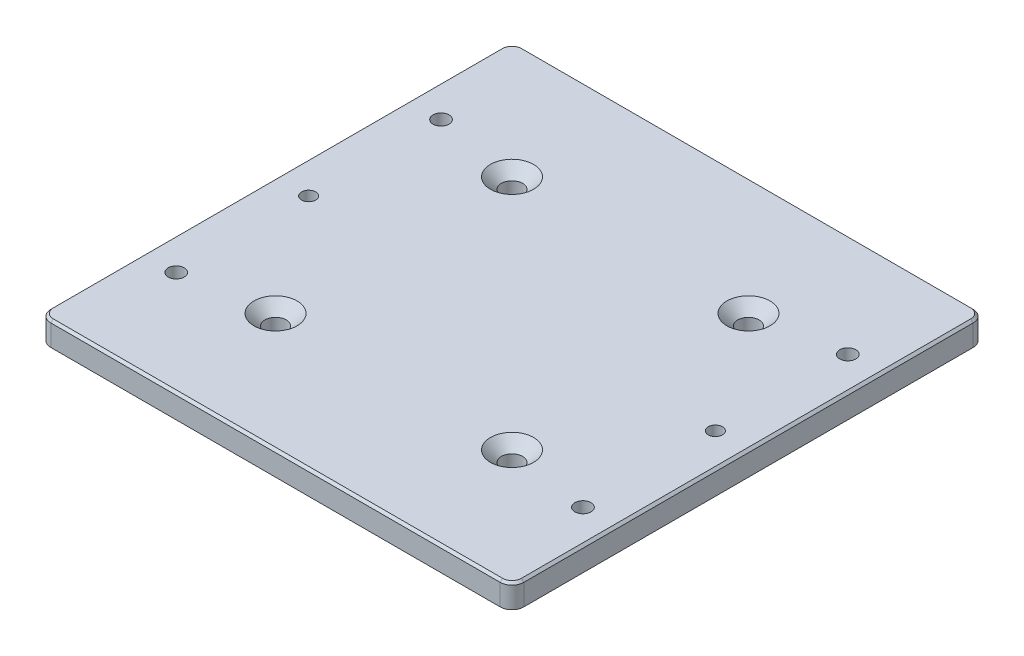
ISO-10303-21;
HEADER;
FILE_DESCRIPTION(('STEP AP214'),'2;1');
FILE_NAME('part.step','',(''),(''),'','','');
FILE_SCHEMA(('AUTOMOTIVE_DESIGN { 1 0 10303 214 1 1 1 1 }'));
ENDSEC;
DATA;
#1=APPLICATION_CONTEXT('core data for automotive mechanical design processes');
#2=APPLICATION_PROTOCOL_DEFINITION('international standard','automotive_design',2000,#1);
#3=PRODUCT_CONTEXT('',#1,'mechanical');
#4=PRODUCT('Part','Part','',(#3));
#5=PRODUCT_RELATED_PRODUCT_CATEGORY('part','',(#4));
#6=PRODUCT_DEFINITION_FORMATION('','',#4);
#7=PRODUCT_DEFINITION_CONTEXT('part definition',#1,'design');
#8=PRODUCT_DEFINITION('design','',#6,#7);
#9=PRODUCT_DEFINITION_SHAPE('','',#8);
#10=(LENGTH_UNIT() NAMED_UNIT(*) SI_UNIT(.MILLI.,.METRE.));
#11=(NAMED_UNIT(*) PLANE_ANGLE_UNIT() SI_UNIT($,.RADIAN.));
#12=(NAMED_UNIT(*) SI_UNIT($,.STERADIAN.) SOLID_ANGLE_UNIT());
#13=UNCERTAINTY_MEASURE_WITH_UNIT(LENGTH_MEASURE(1.E-05),#10,'distance_accuracy_value','');
#14=(GEOMETRIC_REPRESENTATION_CONTEXT(3) GLOBAL_UNCERTAINTY_ASSIGNED_CONTEXT((#13)) GLOBAL_UNIT_ASSIGNED_CONTEXT((#10,
#11,#12)) REPRESENTATION_CONTEXT('',''));
#15=CARTESIAN_POINT('',(0.,0.,0.));
#16=DIRECTION('',(0.,0.,1.));
#17=DIRECTION('',(1.,0.,0.));
#18=AXIS2_PLACEMENT_3D('',#15,#16,#17);
#19=CARTESIAN_POINT('',(100.,-10.,100.));
#20=DIRECTION('',(1.,0.,0.));
#21=DIRECTION('',(0.,0.,-1.));
#22=AXIS2_PLACEMENT_3D('',#19,#20,#21);
#23=PLANE('',#22);
#24=DIRECTION('',(0.,1.,0.));
#25=VECTOR('',#24,1.);
#26=CARTESIAN_POINT('',(100.,-10.,-95.));
#27=LINE('',#26,#25);
#28=CARTESIAN_POINT('',(100.,-10.,-95.));
#29=VERTEX_POINT('',#28);
#30=CARTESIAN_POINT('',(100.,-1.,-95.));
#31=VERTEX_POINT('',#30);
#32=EDGE_CURVE('E137',#29,#31,#27,.T.);
#33=ORIENTED_EDGE('',*,*,#32,.T.);
#34=DIRECTION('',(0.,0.,1.));
#35=VECTOR('',#34,1.);
#36=CARTESIAN_POINT('',(100.,-1.,95.));
#37=LINE('',#36,#35);
#38=CARTESIAN_POINT('',(100.,-1.,95.));
#39=VERTEX_POINT('',#38);
#40=EDGE_CURVE('E133',#31,#39,#37,.T.);
#41=ORIENTED_EDGE('',*,*,#40,.T.);
#42=DIRECTION('',(0.,1.,0.));
#43=VECTOR('',#42,1.);
#44=CARTESIAN_POINT('',(100.,-10.,95.));
#45=LINE('',#44,#43);
#46=CARTESIAN_POINT('',(100.,-10.,95.));
#47=VERTEX_POINT('',#46);
#48=EDGE_CURVE('E127',#39,#47,#45,.F.);
#49=ORIENTED_EDGE('',*,*,#48,.T.);
#50=DIRECTION('',(0.,0.,-1.));
#51=VECTOR('',#50,1.);
#52=CARTESIAN_POINT('',(100.,-10.,100.));
#53=LINE('',#52,#51);
#54=EDGE_CURVE('E130',#47,#29,#53,.T.);
#55=ORIENTED_EDGE('',*,*,#54,.T.);
#56=EDGE_LOOP('',(#33,#41,#49,#55));
#57=FACE_BOUND('',#56,.T.);
#58=ADVANCED_FACE('F37',(#57),#23,.T.);
#59=CARTESIAN_POINT('',(-100.,-10.,100.));
#60=DIRECTION('',(0.,0.,1.));
#61=DIRECTION('',(1.,0.,0.));
#62=AXIS2_PLACEMENT_3D('',#59,#60,#61);
#63=PLANE('',#62);
#64=DIRECTION('',(0.,1.,0.));
#65=VECTOR('',#64,1.);
#66=CARTESIAN_POINT('',(95.,-10.,100.));
#67=LINE('',#66,#65);
#68=CARTESIAN_POINT('',(95.,-10.,100.));
#69=VERTEX_POINT('',#68);
#70=CARTESIAN_POINT('',(95.,-1.,100.));
#71=VERTEX_POINT('',#70);
#72=EDGE_CURVE('E154',#69,#71,#67,.T.);
#73=ORIENTED_EDGE('',*,*,#72,.T.);
#74=DIRECTION('',(-1.,0.,0.));
#75=VECTOR('',#74,1.);
#76=CARTESIAN_POINT('',(-95.,-1.,100.));
#77=LINE('',#76,#75);
#78=CARTESIAN_POINT('',(-95.,-1.,100.));
#79=VERTEX_POINT('',#78);
#80=EDGE_CURVE('E191',#71,#79,#77,.T.);
#81=ORIENTED_EDGE('',*,*,#80,.T.);
#82=DIRECTION('',(0.,1.,0.));
#83=VECTOR('',#82,1.);
#84=CARTESIAN_POINT('',(-95.,-10.,100.));
#85=LINE('',#84,#83);
#86=CARTESIAN_POINT('',(-95.,-10.,100.));
#87=VERTEX_POINT('',#86);
#88=EDGE_CURVE('E172',#79,#87,#85,.F.);
#89=ORIENTED_EDGE('',*,*,#88,.T.);
#90=DIRECTION('',(1.,0.,0.));
#91=VECTOR('',#90,1.);
#92=CARTESIAN_POINT('',(-100.,-10.,100.));
#93=LINE('',#92,#91);
#94=EDGE_CURVE('E138',#87,#69,#93,.T.);
#95=ORIENTED_EDGE('',*,*,#94,.T.);
#96=EDGE_LOOP('',(#73,#81,#89,#95));
#97=FACE_BOUND('',#96,.T.);
#98=ADVANCED_FACE('F342',(#97),#63,.T.);
#99=CARTESIAN_POINT('',(-100.,-10.,100.));
#100=DIRECTION('',(-1.,0.,0.));
#101=DIRECTION('',(0.,0.,1.));
#102=AXIS2_PLACEMENT_3D('',#99,#100,#101);
#103=PLANE('',#102);
#104=DIRECTION('',(0.,1.,0.));
#105=VECTOR('',#104,1.);
#106=CARTESIAN_POINT('',(-100.,-10.,95.));
#107=LINE('',#106,#105);
#108=CARTESIAN_POINT('',(-100.,-10.,95.));
#109=VERTEX_POINT('',#108);
#110=CARTESIAN_POINT('',(-100.,-1.,95.));
#111=VERTEX_POINT('',#110);
#112=EDGE_CURVE('E166',#109,#111,#107,.T.);
#113=ORIENTED_EDGE('',*,*,#112,.T.);
#114=DIRECTION('',(0.,0.,-1.));
#115=VECTOR('',#114,1.);
#116=CARTESIAN_POINT('',(-100.,-1.,-95.));
#117=LINE('',#116,#115);
#118=CARTESIAN_POINT('',(-100.,-1.,-95.));
#119=VERTEX_POINT('',#118);
#120=EDGE_CURVE('E199',#111,#119,#117,.T.);
#121=ORIENTED_EDGE('',*,*,#120,.T.);
#122=DIRECTION('',(0.,1.,0.));
#123=VECTOR('',#122,1.);
#124=CARTESIAN_POINT('',(-100.,-10.,-95.));
#125=LINE('',#124,#123);
#126=CARTESIAN_POINT('',(-100.,-10.,-95.));
#127=VERTEX_POINT('',#126);
#128=EDGE_CURVE('E169',#119,#127,#125,.F.);
#129=ORIENTED_EDGE('',*,*,#128,.T.);
#130=DIRECTION('',(0.,0.,1.));
#131=VECTOR('',#130,1.);
#132=CARTESIAN_POINT('',(-100.,-10.,100.));
#133=LINE('',#132,#131);
#134=EDGE_CURVE('E305',#127,#109,#133,.T.);
#135=ORIENTED_EDGE('',*,*,#134,.T.);
#136=EDGE_LOOP('',(#113,#121,#129,#135));
#137=FACE_BOUND('',#136,.T.);
#138=ADVANCED_FACE('F354',(#137),#103,.T.);
#139=CARTESIAN_POINT('',(-100.,-10.,-100.));
#140=DIRECTION('',(0.,0.,-1.));
#141=DIRECTION('',(-1.,0.,0.));
#142=AXIS2_PLACEMENT_3D('',#139,#140,#141);
#143=PLANE('',#142);
#144=DIRECTION('',(0.,1.,0.));
#145=VECTOR('',#144,1.);
#146=CARTESIAN_POINT('',(-95.,-10.,-100.));
#147=LINE('',#146,#145);
#148=CARTESIAN_POINT('',(-95.,-10.,-100.));
#149=VERTEX_POINT('',#148);
#150=CARTESIAN_POINT('',(-95.,-1.,-100.));
#151=VERTEX_POINT('',#150);
#152=EDGE_CURVE('E160',#149,#151,#147,.T.);
#153=ORIENTED_EDGE('',*,*,#152,.T.);
#154=DIRECTION('',(1.,0.,0.));
#155=VECTOR('',#154,1.);
#156=CARTESIAN_POINT('',(95.,-1.,-100.));
#157=LINE('',#156,#155);
#158=CARTESIAN_POINT('',(95.,-1.,-100.));
#159=VERTEX_POINT('',#158);
#160=EDGE_CURVE('E11',#151,#159,#157,.T.);
#161=ORIENTED_EDGE('',*,*,#160,.T.);
#162=DIRECTION('',(0.,1.,0.));
#163=VECTOR('',#162,1.);
#164=CARTESIAN_POINT('',(95.,-10.,-100.));
#165=LINE('',#164,#163);
#166=CARTESIAN_POINT('',(95.,-10.,-100.));
#167=VERTEX_POINT('',#166);
#168=EDGE_CURVE('E156',#159,#167,#165,.F.);
#169=ORIENTED_EDGE('',*,*,#168,.T.);
#170=DIRECTION('',(-1.,0.,0.));
#171=VECTOR('',#170,1.);
#172=CARTESIAN_POINT('',(-100.,-10.,-100.));
#173=LINE('',#172,#171);
#174=EDGE_CURVE('E148',#167,#149,#173,.T.);
#175=ORIENTED_EDGE('',*,*,#174,.T.);
#176=EDGE_LOOP('',(#153,#161,#169,#175));
#177=FACE_BOUND('',#176,.T.);
#178=ADVANCED_FACE('F309',(#177),#143,.T.);
#179=CARTESIAN_POINT('',(0.,-10.,0.));
#180=DIRECTION('',(0.,-1.,0.));
#181=DIRECTION('',(0.,0.,-1.));
#182=AXIS2_PLACEMENT_3D('',#179,#180,#181);
#183=PLANE('',#182);
#184=CARTESIAN_POINT('',(86.,-10.,0.));
#185=DIRECTION('',(0.,1.,0.));
#186=DIRECTION('',(0.,0.,1.));
#187=AXIS2_PLACEMENT_3D('',#184,#185,#186);
#188=CIRCLE('',#187,3.);
#189=CARTESIAN_POINT('',(86.,-10.,3.00000000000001));
#190=VERTEX_POINT('',#189);
#191=EDGE_CURVE('E231',#190,#190,#188,.T.);
#192=ORIENTED_EDGE('',*,*,#191,.T.);
#193=EDGE_LOOP('',(#192));
#194=FACE_BOUND('',#193,.T.);
#195=CARTESIAN_POINT('',(-86.,-10.,0.));
#196=DIRECTION('',(0.,1.,0.));
#197=DIRECTION('',(0.,0.,1.));
#198=AXIS2_PLACEMENT_3D('',#195,#196,#197);
#199=CIRCLE('',#198,3.);
#200=CARTESIAN_POINT('',(-86.,-10.,3.00000000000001));
#201=VERTEX_POINT('',#200);
#202=EDGE_CURVE('E241',#201,#201,#199,.T.);
#203=ORIENTED_EDGE('',*,*,#202,.T.);
#204=EDGE_LOOP('',(#203));
#205=FACE_BOUND('',#204,.T.);
#206=CARTESIAN_POINT('',(-50.,-10.,50.));
#207=DIRECTION('',(0.,1.,0.));
#208=DIRECTION('',(0.,0.,1.));
#209=AXIS2_PLACEMENT_3D('',#206,#207,#208);
#210=CIRCLE('',#209,4.5);
#211=CARTESIAN_POINT('',(-50.,-10.,54.5));
#212=VERTEX_POINT('',#211);
#213=EDGE_CURVE('E250',#212,#212,#210,.T.);
#214=ORIENTED_EDGE('',*,*,#213,.T.);
#215=EDGE_LOOP('',(#214));
#216=FACE_BOUND('',#215,.T.);
#217=CARTESIAN_POINT('',(50.,-10.,-50.));
#218=DIRECTION('',(0.,1.,0.));
#219=DIRECTION('',(0.,0.,1.));
#220=AXIS2_PLACEMENT_3D('',#217,#218,#219);
#221=CIRCLE('',#220,4.5);
#222=CARTESIAN_POINT('',(50.,-10.,-45.5));
#223=VERTEX_POINT('',#222);
#224=EDGE_CURVE('E259',#223,#223,#221,.T.);
#225=ORIENTED_EDGE('',*,*,#224,.T.);
#226=EDGE_LOOP('',(#225));
#227=FACE_BOUND('',#226,.T.);
#228=CARTESIAN_POINT('',(-50.,-10.,-50.));
#229=DIRECTION('',(0.,1.,0.));
#230=DIRECTION('',(0.,0.,1.));
#231=AXIS2_PLACEMENT_3D('',#228,#229,#230);
#232=CIRCLE('',#231,4.5);
#233=CARTESIAN_POINT('',(-50.,-10.,-45.5));
#234=VERTEX_POINT('',#233);
#235=EDGE_CURVE('E268',#234,#234,#232,.T.);
#236=ORIENTED_EDGE('',*,*,#235,.T.);
#237=EDGE_LOOP('',(#236));
#238=FACE_BOUND('',#237,.T.);
#239=CARTESIAN_POINT('',(50.,-10.,50.));
#240=DIRECTION('',(0.,1.,0.));
#241=DIRECTION('',(0.,0.,1.));
#242=AXIS2_PLACEMENT_3D('',#239,#240,#241);
#243=CIRCLE('',#242,4.5);
#244=CARTESIAN_POINT('',(50.,-10.,54.5));
#245=VERTEX_POINT('',#244);
#246=EDGE_CURVE('E277',#245,#245,#243,.T.);
#247=ORIENTED_EDGE('',*,*,#246,.T.);
#248=EDGE_LOOP('',(#247));
#249=FACE_BOUND('',#248,.T.);
#250=CARTESIAN_POINT('',(-86.,-10.,56.));
#251=DIRECTION('',(0.,1.,0.));
#252=DIRECTION('',(0.,0.,1.));
#253=AXIS2_PLACEMENT_3D('',#250,#251,#252);
#254=CIRCLE('',#253,3.4);
#255=CARTESIAN_POINT('',(-86.,-10.,59.4));
#256=VERTEX_POINT('',#255);
#257=EDGE_CURVE('E283',#256,#256,#254,.T.);
#258=ORIENTED_EDGE('',*,*,#257,.T.);
#259=EDGE_LOOP('',(#258));
#260=FACE_BOUND('',#259,.T.);
#261=CARTESIAN_POINT('',(86.,-10.,-56.));
#262=DIRECTION('',(0.,1.,0.));
#263=DIRECTION('',(0.,0.,1.));
#264=AXIS2_PLACEMENT_3D('',#261,#262,#263);
#265=CIRCLE('',#264,3.4);
#266=CARTESIAN_POINT('',(86.,-10.,-52.6));
#267=VERTEX_POINT('',#266);
#268=EDGE_CURVE('E289',#267,#267,#265,.T.);
#269=ORIENTED_EDGE('',*,*,#268,.T.);
#270=EDGE_LOOP('',(#269));
#271=FACE_BOUND('',#270,.T.);
#272=CARTESIAN_POINT('',(-86.,-10.,-56.));
#273=DIRECTION('',(0.,1.,0.));
#274=DIRECTION('',(0.,0.,1.));
#275=AXIS2_PLACEMENT_3D('',#272,#273,#274);
#276=CIRCLE('',#275,3.4);
#277=CARTESIAN_POINT('',(-86.,-10.,-52.6));
#278=VERTEX_POINT('',#277);
#279=EDGE_CURVE('E295',#278,#278,#276,.T.);
#280=ORIENTED_EDGE('',*,*,#279,.T.);
#281=EDGE_LOOP('',(#280));
#282=FACE_BOUND('',#281,.T.);
#283=CARTESIAN_POINT('',(86.,-10.,56.));
#284=DIRECTION('',(0.,1.,0.));
#285=DIRECTION('',(0.,0.,1.));
#286=AXIS2_PLACEMENT_3D('',#283,#284,#285);
#287=CIRCLE('',#286,3.4);
#288=CARTESIAN_POINT('',(86.,-10.,59.4));
#289=VERTEX_POINT('',#288);
#290=EDGE_CURVE('E149',#289,#289,#287,.T.);
#291=ORIENTED_EDGE('',*,*,#290,.T.);
#292=EDGE_LOOP('',(#291));
#293=FACE_BOUND('',#292,.T.);
#294=ORIENTED_EDGE('',*,*,#174,.F.);
#295=CARTESIAN_POINT('',(95.,-10.,-95.));
#296=DIRECTION('',(0.,-1.,0.));
#297=DIRECTION('',(0.,0.,-1.));
#298=AXIS2_PLACEMENT_3D('',#295,#296,#297);
#299=CIRCLE('',#298,5.);
#300=EDGE_CURVE('E147',#167,#29,#299,.T.);
#301=ORIENTED_EDGE('',*,*,#300,.T.);
#302=ORIENTED_EDGE('',*,*,#54,.F.);
#303=CARTESIAN_POINT('',(95.,-10.,95.));
#304=DIRECTION('',(0.,-1.,0.));
#305=DIRECTION('',(0.,0.,-1.));
#306=AXIS2_PLACEMENT_3D('',#303,#304,#305);
#307=CIRCLE('',#306,5.);
#308=EDGE_CURVE('E144',#47,#69,#307,.T.);
#309=ORIENTED_EDGE('',*,*,#308,.T.);
#310=ORIENTED_EDGE('',*,*,#94,.F.);
#311=CARTESIAN_POINT('',(-95.,-10.,95.));
#312=DIRECTION('',(0.,-1.,0.));
#313=DIRECTION('',(0.,0.,-1.));
#314=AXIS2_PLACEMENT_3D('',#311,#312,#313);
#315=CIRCLE('',#314,5.);
#316=EDGE_CURVE('E155',#87,#109,#315,.T.);
#317=ORIENTED_EDGE('',*,*,#316,.T.);
#318=ORIENTED_EDGE('',*,*,#134,.F.);
#319=CARTESIAN_POINT('',(-95.,-10.,-95.));
#320=DIRECTION('',(0.,-1.,0.));
#321=DIRECTION('',(0.,0.,-1.));
#322=AXIS2_PLACEMENT_3D('',#319,#320,#321);
#323=CIRCLE('',#322,5.);
#324=EDGE_CURVE('E158',#127,#149,#323,.T.);
#325=ORIENTED_EDGE('',*,*,#324,.T.);
#326=EDGE_LOOP('',(#294,#301,#302,#309,#310,#317,#318,#325));
#327=FACE_BOUND('',#326,.T.);
#328=ADVANCED_FACE('F142',(#194,#205,#216,#227,#238,#249,#260,#271,#282,#293,#327),#183,.T.);
#329=CARTESIAN_POINT('',(0.,0.,0.));
#330=DIRECTION('',(0.,-1.,0.));
#331=DIRECTION('',(0.,0.,-1.));
#332=AXIS2_PLACEMENT_3D('',#329,#330,#331);
#333=PLANE('',#332);
#334=CARTESIAN_POINT('',(-95.,0.,95.));
#335=DIRECTION('',(0.,-1.,0.));
#336=DIRECTION('',(0.,0.,-1.));
#337=AXIS2_PLACEMENT_3D('',#334,#335,#336);
#338=CIRCLE('',#337,4.);
#339=CARTESIAN_POINT('',(-99.,0.,95.));
#340=VERTEX_POINT('',#339);
#341=CARTESIAN_POINT('',(-95.,0.,99.));
#342=VERTEX_POINT('',#341);
#343=EDGE_CURVE('E184',#340,#342,#338,.F.);
#344=ORIENTED_EDGE('',*,*,#343,.T.);
#345=DIRECTION('',(1.,0.,0.));
#346=VECTOR('',#345,1.);
#347=CARTESIAN_POINT('',(95.,0.,99.));
#348=LINE('',#347,#346);
#349=CARTESIAN_POINT('',(95.,0.,99.));
#350=VERTEX_POINT('',#349);
#351=EDGE_CURVE('E188',#342,#350,#348,.T.);
#352=ORIENTED_EDGE('',*,*,#351,.T.);
#353=CARTESIAN_POINT('',(95.,0.,95.));
#354=DIRECTION('',(0.,-1.,0.));
#355=DIRECTION('',(0.,0.,-1.));
#356=AXIS2_PLACEMENT_3D('',#353,#354,#355);
#357=CIRCLE('',#356,4.);
#358=CARTESIAN_POINT('',(99.,0.,95.));
#359=VERTEX_POINT('',#358);
#360=EDGE_CURVE('E186',#350,#359,#357,.F.);
#361=ORIENTED_EDGE('',*,*,#360,.T.);
#362=DIRECTION('',(0.,0.,-1.));
#363=VECTOR('',#362,1.);
#364=CARTESIAN_POINT('',(99.,0.,-95.));
#365=LINE('',#364,#363);
#366=CARTESIAN_POINT('',(99.,0.,-95.));
#367=VERTEX_POINT('',#366);
#368=EDGE_CURVE('E182',#359,#367,#365,.T.);
#369=ORIENTED_EDGE('',*,*,#368,.T.);
#370=CARTESIAN_POINT('',(95.,0.,-95.));
#371=DIRECTION('',(0.,-1.,0.));
#372=DIRECTION('',(0.,0.,-1.));
#373=AXIS2_PLACEMENT_3D('',#370,#371,#372);
#374=CIRCLE('',#373,4.);
#375=CARTESIAN_POINT('',(95.,0.,-99.));
#376=VERTEX_POINT('',#375);
#377=EDGE_CURVE('E178',#367,#376,#374,.F.);
#378=ORIENTED_EDGE('',*,*,#377,.T.);
#379=DIRECTION('',(-1.,0.,0.));
#380=VECTOR('',#379,1.);
#381=CARTESIAN_POINT('',(-95.,0.,-99.));
#382=LINE('',#381,#380);
#383=CARTESIAN_POINT('',(-95.,0.,-99.));
#384=VERTEX_POINT('',#383);
#385=EDGE_CURVE('E174',#376,#384,#382,.T.);
#386=ORIENTED_EDGE('',*,*,#385,.T.);
#387=CARTESIAN_POINT('',(-95.,0.,-95.));
#388=DIRECTION('',(0.,-1.,0.));
#389=DIRECTION('',(0.,0.,-1.));
#390=AXIS2_PLACEMENT_3D('',#387,#388,#389);
#391=CIRCLE('',#390,4.);
#392=CARTESIAN_POINT('',(-99.,0.,-95.));
#393=VERTEX_POINT('',#392);
#394=EDGE_CURVE('E176',#384,#393,#391,.F.);
#395=ORIENTED_EDGE('',*,*,#394,.T.);
#396=DIRECTION('',(0.,0.,1.));
#397=VECTOR('',#396,1.);
#398=CARTESIAN_POINT('',(-99.,0.,95.));
#399=LINE('',#398,#397);
#400=EDGE_CURVE('E180',#393,#340,#399,.T.);
#401=ORIENTED_EDGE('',*,*,#400,.T.);
#402=EDGE_LOOP('',(#344,#352,#361,#369,#378,#386,#395,#401));
#403=FACE_BOUND('',#402,.T.);
#404=CARTESIAN_POINT('',(86.,0.,0.));
#405=DIRECTION('',(0.,1.,0.));
#406=DIRECTION('',(0.,0.,1.));
#407=AXIS2_PLACEMENT_3D('',#404,#405,#406);
#408=CIRCLE('',#407,3.);
#409=CARTESIAN_POINT('',(86.,0.,3.00000000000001));
#410=VERTEX_POINT('',#409);
#411=EDGE_CURVE('E226',#410,#410,#408,.T.);
#412=ORIENTED_EDGE('',*,*,#411,.F.);
#413=EDGE_LOOP('',(#412));
#414=FACE_BOUND('',#413,.T.);
#415=CARTESIAN_POINT('',(-86.,0.,0.));
#416=DIRECTION('',(0.,1.,0.));
#417=DIRECTION('',(0.,0.,1.));
#418=AXIS2_PLACEMENT_3D('',#415,#416,#417);
#419=CIRCLE('',#418,3.);
#420=CARTESIAN_POINT('',(-86.,0.,3.00000000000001));
#421=VERTEX_POINT('',#420);
#422=EDGE_CURVE('E236',#421,#421,#419,.T.);
#423=ORIENTED_EDGE('',*,*,#422,.F.);
#424=EDGE_LOOP('',(#423));
#425=FACE_BOUND('',#424,.T.);
#426=CARTESIAN_POINT('',(-50.,0.,50.));
#427=DIRECTION('',(0.,1.,0.));
#428=DIRECTION('',(0.,0.,1.));
#429=AXIS2_PLACEMENT_3D('',#426,#427,#428);
#430=CIRCLE('',#429,9.125);
#431=CARTESIAN_POINT('',(-50.,0.,59.125));
#432=VERTEX_POINT('',#431);
#433=EDGE_CURVE('E244',#432,#432,#430,.T.);
#434=ORIENTED_EDGE('',*,*,#433,.F.);
#435=EDGE_LOOP('',(#434));
#436=FACE_BOUND('',#435,.T.);
#437=CARTESIAN_POINT('',(50.,0.,-50.));
#438=DIRECTION('',(0.,1.,0.));
#439=DIRECTION('',(0.,0.,1.));
#440=AXIS2_PLACEMENT_3D('',#437,#438,#439);
#441=CIRCLE('',#440,9.125);
#442=CARTESIAN_POINT('',(50.,0.,-40.875));
#443=VERTEX_POINT('',#442);
#444=EDGE_CURVE('E253',#443,#443,#441,.T.);
#445=ORIENTED_EDGE('',*,*,#444,.F.);
#446=EDGE_LOOP('',(#445));
#447=FACE_BOUND('',#446,.T.);
#448=CARTESIAN_POINT('',(-50.,0.,-50.));
#449=DIRECTION('',(0.,1.,0.));
#450=DIRECTION('',(0.,0.,1.));
#451=AXIS2_PLACEMENT_3D('',#448,#449,#450);
#452=CIRCLE('',#451,9.125);
#453=CARTESIAN_POINT('',(-50.,0.,-40.875));
#454=VERTEX_POINT('',#453);
#455=EDGE_CURVE('E262',#454,#454,#452,.T.);
#456=ORIENTED_EDGE('',*,*,#455,.F.);
#457=EDGE_LOOP('',(#456));
#458=FACE_BOUND('',#457,.T.);
#459=CARTESIAN_POINT('',(50.,0.,50.));
#460=DIRECTION('',(0.,1.,0.));
#461=DIRECTION('',(0.,0.,1.));
#462=AXIS2_PLACEMENT_3D('',#459,#460,#461);
#463=CIRCLE('',#462,9.125);
#464=CARTESIAN_POINT('',(50.,0.,59.125));
#465=VERTEX_POINT('',#464);
#466=EDGE_CURVE('E271',#465,#465,#463,.T.);
#467=ORIENTED_EDGE('',*,*,#466,.F.);
#468=EDGE_LOOP('',(#467));
#469=FACE_BOUND('',#468,.T.);
#470=CARTESIAN_POINT('',(-86.,0.,56.));
#471=DIRECTION('',(0.,1.,0.));
#472=DIRECTION('',(0.,0.,1.));
#473=AXIS2_PLACEMENT_3D('',#470,#471,#472);
#474=CIRCLE('',#473,3.4);
#475=CARTESIAN_POINT('',(-86.,0.,59.4));
#476=VERTEX_POINT('',#475);
#477=EDGE_CURVE('E280',#476,#476,#474,.T.);
#478=ORIENTED_EDGE('',*,*,#477,.F.);
#479=EDGE_LOOP('',(#478));
#480=FACE_BOUND('',#479,.T.);
#481=CARTESIAN_POINT('',(86.,0.,-56.));
#482=DIRECTION('',(0.,1.,0.));
#483=DIRECTION('',(0.,0.,1.));
#484=AXIS2_PLACEMENT_3D('',#481,#482,#483);
#485=CIRCLE('',#484,3.4);
#486=CARTESIAN_POINT('',(86.,0.,-52.6));
#487=VERTEX_POINT('',#486);
#488=EDGE_CURVE('E286',#487,#487,#485,.T.);
#489=ORIENTED_EDGE('',*,*,#488,.F.);
#490=EDGE_LOOP('',(#489));
#491=FACE_BOUND('',#490,.T.);
#492=CARTESIAN_POINT('',(-86.,0.,-56.));
#493=DIRECTION('',(0.,1.,0.));
#494=DIRECTION('',(0.,0.,1.));
#495=AXIS2_PLACEMENT_3D('',#492,#493,#494);
#496=CIRCLE('',#495,3.4);
#497=CARTESIAN_POINT('',(-86.,0.,-52.6));
#498=VERTEX_POINT('',#497);
#499=EDGE_CURVE('E292',#498,#498,#496,.T.);
#500=ORIENTED_EDGE('',*,*,#499,.F.);
#501=EDGE_LOOP('',(#500));
#502=FACE_BOUND('',#501,.T.);
#503=CARTESIAN_POINT('',(86.,0.,56.));
#504=DIRECTION('',(0.,1.,0.));
#505=DIRECTION('',(0.,0.,1.));
#506=AXIS2_PLACEMENT_3D('',#503,#504,#505);
#507=CIRCLE('',#506,3.4);
#508=CARTESIAN_POINT('',(86.,0.,59.4));
#509=VERTEX_POINT('',#508);
#510=EDGE_CURVE('E298',#509,#509,#507,.T.);
#511=ORIENTED_EDGE('',*,*,#510,.F.);
#512=EDGE_LOOP('',(#511));
#513=FACE_BOUND('',#512,.T.);
#514=ADVANCED_FACE('F329',(#403,#414,#425,#436,#447,#458,#469,#480,#491,#502,#513),#333,.F.);
#515=CARTESIAN_POINT('',(86.,0.,56.));
#516=DIRECTION('',(0.,1.,0.));
#517=DIRECTION('',(0.,0.,1.));
#518=AXIS2_PLACEMENT_3D('',#515,#516,#517);
#519=CYLINDRICAL_SURFACE('',#518,3.4);
#520=ORIENTED_EDGE('',*,*,#290,.F.);
#521=EDGE_LOOP('',(#520));
#522=FACE_BOUND('',#521,.T.);
#523=ORIENTED_EDGE('',*,*,#510,.T.);
#524=EDGE_LOOP('',(#523));
#525=FACE_BOUND('',#524,.T.);
#526=ADVANCED_FACE('F515',(#522,#525),#519,.F.);
#527=CARTESIAN_POINT('',(-86.,0.,-56.));
#528=DIRECTION('',(0.,1.,0.));
#529=DIRECTION('',(0.,0.,1.));
#530=AXIS2_PLACEMENT_3D('',#527,#528,#529);
#531=CYLINDRICAL_SURFACE('',#530,3.4);
#532=ORIENTED_EDGE('',*,*,#279,.F.);
#533=EDGE_LOOP('',(#532));
#534=FACE_BOUND('',#533,.T.);
#535=ORIENTED_EDGE('',*,*,#499,.T.);
#536=EDGE_LOOP('',(#535));
#537=FACE_BOUND('',#536,.T.);
#538=ADVANCED_FACE('F507',(#534,#537),#531,.F.);
#539=CARTESIAN_POINT('',(86.,0.,-56.));
#540=DIRECTION('',(0.,1.,0.));
#541=DIRECTION('',(0.,0.,1.));
#542=AXIS2_PLACEMENT_3D('',#539,#540,#541);
#543=CYLINDRICAL_SURFACE('',#542,3.4);
#544=ORIENTED_EDGE('',*,*,#268,.F.);
#545=EDGE_LOOP('',(#544));
#546=FACE_BOUND('',#545,.T.);
#547=ORIENTED_EDGE('',*,*,#488,.T.);
#548=EDGE_LOOP('',(#547));
#549=FACE_BOUND('',#548,.T.);
#550=ADVANCED_FACE('F500',(#546,#549),#543,.F.);
#551=CARTESIAN_POINT('',(-86.,0.,56.));
#552=DIRECTION('',(0.,1.,0.));
#553=DIRECTION('',(0.,0.,1.));
#554=AXIS2_PLACEMENT_3D('',#551,#552,#553);
#555=CYLINDRICAL_SURFACE('',#554,3.4);
#556=ORIENTED_EDGE('',*,*,#257,.F.);
#557=EDGE_LOOP('',(#556));
#558=FACE_BOUND('',#557,.T.);
#559=ORIENTED_EDGE('',*,*,#477,.T.);
#560=EDGE_LOOP('',(#559));
#561=FACE_BOUND('',#560,.T.);
#562=ADVANCED_FACE('F491',(#558,#561),#555,.F.);
#563=CARTESIAN_POINT('',(50.,0.,50.));
#564=DIRECTION('',(0.,1.,0.));
#565=DIRECTION('',(0.,0.,1.));
#566=AXIS2_PLACEMENT_3D('',#563,#564,#565);
#567=CYLINDRICAL_SURFACE('',#566,4.5);
#568=ORIENTED_EDGE('',*,*,#246,.F.);
#569=EDGE_LOOP('',(#568));
#570=FACE_BOUND('',#569,.T.);
#571=CARTESIAN_POINT('',(50.,-4.625,50.));
#572=DIRECTION('',(0.,1.,0.));
#573=DIRECTION('',(0.,0.,1.));
#574=AXIS2_PLACEMENT_3D('',#571,#572,#573);
#575=CIRCLE('',#574,4.5);
#576=CARTESIAN_POINT('',(50.,-4.625,54.5));
#577=VERTEX_POINT('',#576);
#578=EDGE_CURVE('E274',#577,#577,#575,.T.);
#579=ORIENTED_EDGE('',*,*,#578,.T.);
#580=EDGE_LOOP('',(#579));
#581=FACE_BOUND('',#580,.T.);
#582=ADVANCED_FACE('F484',(#570,#581),#567,.F.);
#583=CARTESIAN_POINT('',(50.,0.,50.));
#584=DIRECTION('',(0.,1.,0.));
#585=DIRECTION('',(0.,0.,1.));
#586=AXIS2_PLACEMENT_3D('',#583,#584,#585);
#587=CONICAL_SURFACE('',#586,9.125,0.785398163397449);
#588=ORIENTED_EDGE('',*,*,#578,.F.);
#589=EDGE_LOOP('',(#588));
#590=FACE_BOUND('',#589,.T.);
#591=ORIENTED_EDGE('',*,*,#466,.T.);
#592=EDGE_LOOP('',(#591));
#593=FACE_BOUND('',#592,.T.);
#594=ADVANCED_FACE('F476',(#590,#593),#587,.F.);
#595=CARTESIAN_POINT('',(-50.,0.,-50.));
#596=DIRECTION('',(0.,1.,0.));
#597=DIRECTION('',(0.,0.,1.));
#598=AXIS2_PLACEMENT_3D('',#595,#596,#597);
#599=CYLINDRICAL_SURFACE('',#598,4.5);
#600=ORIENTED_EDGE('',*,*,#235,.F.);
#601=EDGE_LOOP('',(#600));
#602=FACE_BOUND('',#601,.T.);
#603=CARTESIAN_POINT('',(-50.,-4.625,-50.));
#604=DIRECTION('',(0.,1.,0.));
#605=DIRECTION('',(0.,0.,1.));
#606=AXIS2_PLACEMENT_3D('',#603,#604,#605);
#607=CIRCLE('',#606,4.5);
#608=CARTESIAN_POINT('',(-50.,-4.625,-45.5));
#609=VERTEX_POINT('',#608);
#610=EDGE_CURVE('E265',#609,#609,#607,.T.);
#611=ORIENTED_EDGE('',*,*,#610,.T.);
#612=EDGE_LOOP('',(#611));
#613=FACE_BOUND('',#612,.T.);
#614=ADVANCED_FACE('F468',(#602,#613),#599,.F.);
#615=CARTESIAN_POINT('',(-50.,0.,-50.));
#616=DIRECTION('',(0.,1.,0.));
#617=DIRECTION('',(0.,0.,1.));
#618=AXIS2_PLACEMENT_3D('',#615,#616,#617);
#619=CONICAL_SURFACE('',#618,9.125,0.785398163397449);
#620=ORIENTED_EDGE('',*,*,#610,.F.);
#621=EDGE_LOOP('',(#620));
#622=FACE_BOUND('',#621,.T.);
#623=ORIENTED_EDGE('',*,*,#455,.T.);
#624=EDGE_LOOP('',(#623));
#625=FACE_BOUND('',#624,.T.);
#626=ADVANCED_FACE('F460',(#622,#625),#619,.F.);
#627=CARTESIAN_POINT('',(50.,0.,-50.));
#628=DIRECTION('',(0.,1.,0.));
#629=DIRECTION('',(0.,0.,1.));
#630=AXIS2_PLACEMENT_3D('',#627,#628,#629);
#631=CYLINDRICAL_SURFACE('',#630,4.5);
#632=ORIENTED_EDGE('',*,*,#224,.F.);
#633=EDGE_LOOP('',(#632));
#634=FACE_BOUND('',#633,.T.);
#635=CARTESIAN_POINT('',(50.,-4.625,-50.));
#636=DIRECTION('',(0.,1.,0.));
#637=DIRECTION('',(0.,0.,1.));
#638=AXIS2_PLACEMENT_3D('',#635,#636,#637);
#639=CIRCLE('',#638,4.5);
#640=CARTESIAN_POINT('',(50.,-4.625,-45.5));
#641=VERTEX_POINT('',#640);
#642=EDGE_CURVE('E256',#641,#641,#639,.T.);
#643=ORIENTED_EDGE('',*,*,#642,.T.);
#644=EDGE_LOOP('',(#643));
#645=FACE_BOUND('',#644,.T.);
#646=ADVANCED_FACE('F452',(#634,#645),#631,.F.);
#647=CARTESIAN_POINT('',(50.,0.,-50.));
#648=DIRECTION('',(0.,1.,0.));
#649=DIRECTION('',(0.,0.,1.));
#650=AXIS2_PLACEMENT_3D('',#647,#648,#649);
#651=CONICAL_SURFACE('',#650,9.125,0.785398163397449);
#652=ORIENTED_EDGE('',*,*,#642,.F.);
#653=EDGE_LOOP('',(#652));
#654=FACE_BOUND('',#653,.T.);
#655=ORIENTED_EDGE('',*,*,#444,.T.);
#656=EDGE_LOOP('',(#655));
#657=FACE_BOUND('',#656,.T.);
#658=ADVANCED_FACE('F444',(#654,#657),#651,.F.);
#659=CARTESIAN_POINT('',(-50.,0.,50.));
#660=DIRECTION('',(0.,1.,0.));
#661=DIRECTION('',(0.,0.,1.));
#662=AXIS2_PLACEMENT_3D('',#659,#660,#661);
#663=CYLINDRICAL_SURFACE('',#662,4.5);
#664=ORIENTED_EDGE('',*,*,#213,.F.);
#665=EDGE_LOOP('',(#664));
#666=FACE_BOUND('',#665,.T.);
#667=CARTESIAN_POINT('',(-50.,-4.625,50.));
#668=DIRECTION('',(0.,1.,0.));
#669=DIRECTION('',(0.,0.,1.));
#670=AXIS2_PLACEMENT_3D('',#667,#668,#669);
#671=CIRCLE('',#670,4.5);
#672=CARTESIAN_POINT('',(-50.,-4.625,54.5));
#673=VERTEX_POINT('',#672);
#674=EDGE_CURVE('E247',#673,#673,#671,.T.);
#675=ORIENTED_EDGE('',*,*,#674,.T.);
#676=EDGE_LOOP('',(#675));
#677=FACE_BOUND('',#676,.T.);
#678=ADVANCED_FACE('F435',(#666,#677),#663,.F.);
#679=CARTESIAN_POINT('',(-50.,0.,50.));
#680=DIRECTION('',(0.,1.,0.));
#681=DIRECTION('',(0.,0.,1.));
#682=AXIS2_PLACEMENT_3D('',#679,#680,#681);
#683=CONICAL_SURFACE('',#682,9.125,0.785398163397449);
#684=ORIENTED_EDGE('',*,*,#674,.F.);
#685=EDGE_LOOP('',(#684));
#686=FACE_BOUND('',#685,.T.);
#687=ORIENTED_EDGE('',*,*,#433,.T.);
#688=EDGE_LOOP('',(#687));
#689=FACE_BOUND('',#688,.T.);
#690=ADVANCED_FACE('F426',(#686,#689),#683,.F.);
#691=CARTESIAN_POINT('',(-86.,0.,0.));
#692=DIRECTION('',(0.,1.,0.));
#693=DIRECTION('',(0.,0.,1.));
#694=AXIS2_PLACEMENT_3D('',#691,#692,#693);
#695=CYLINDRICAL_SURFACE('',#694,3.);
#696=ORIENTED_EDGE('',*,*,#202,.F.);
#697=EDGE_LOOP('',(#696));
#698=FACE_BOUND('',#697,.T.);
#699=ORIENTED_EDGE('',*,*,#422,.T.);
#700=EDGE_LOOP('',(#699));
#701=FACE_BOUND('',#700,.T.);
#702=ADVANCED_FACE('F417',(#698,#701),#695,.F.);
#703=CARTESIAN_POINT('',(86.,0.,0.));
#704=DIRECTION('',(0.,1.,0.));
#705=DIRECTION('',(0.,0.,1.));
#706=AXIS2_PLACEMENT_3D('',#703,#704,#705);
#707=CYLINDRICAL_SURFACE('',#706,3.);
#708=ORIENTED_EDGE('',*,*,#191,.F.);
#709=EDGE_LOOP('',(#708));
#710=FACE_BOUND('',#709,.T.);
#711=ORIENTED_EDGE('',*,*,#411,.T.);
#712=EDGE_LOOP('',(#711));
#713=FACE_BOUND('',#712,.T.);
#714=ADVANCED_FACE('F370',(#710,#713),#707,.F.);
#715=CARTESIAN_POINT('',(95.,-10.,-95.));
#716=DIRECTION('',(0.,1.,0.));
#717=DIRECTION('',(0.,0.,1.));
#718=AXIS2_PLACEMENT_3D('',#715,#716,#717);
#719=CYLINDRICAL_SURFACE('',#718,5.);
#720=ORIENTED_EDGE('',*,*,#168,.F.);
#721=CARTESIAN_POINT('',(95.,-1.,-95.));
#722=DIRECTION('',(0.,-1.,0.));
#723=DIRECTION('',(0.,0.,-1.));
#724=AXIS2_PLACEMENT_3D('',#721,#722,#723);
#725=CIRCLE('',#724,5.);
#726=EDGE_CURVE('E201',#159,#31,#725,.T.);
#727=ORIENTED_EDGE('',*,*,#726,.T.);
#728=ORIENTED_EDGE('',*,*,#32,.F.);
#729=ORIENTED_EDGE('',*,*,#300,.F.);
#730=EDGE_LOOP('',(#720,#727,#728,#729));
#731=FACE_BOUND('',#730,.T.);
#732=ADVANCED_FACE('F316',(#731),#719,.T.);
#733=CARTESIAN_POINT('',(-95.,-10.,-95.));
#734=DIRECTION('',(0.,1.,0.));
#735=DIRECTION('',(0.,0.,1.));
#736=AXIS2_PLACEMENT_3D('',#733,#734,#735);
#737=CYLINDRICAL_SURFACE('',#736,5.);
#738=ORIENTED_EDGE('',*,*,#128,.F.);
#739=CARTESIAN_POINT('',(-95.,-1.,-95.));
#740=DIRECTION('',(0.,-1.,0.));
#741=DIRECTION('',(0.,0.,-1.));
#742=AXIS2_PLACEMENT_3D('',#739,#740,#741);
#743=CIRCLE('',#742,5.);
#744=EDGE_CURVE('E46',#119,#151,#743,.T.);
#745=ORIENTED_EDGE('',*,*,#744,.T.);
#746=ORIENTED_EDGE('',*,*,#152,.F.);
#747=ORIENTED_EDGE('',*,*,#324,.F.);
#748=EDGE_LOOP('',(#738,#745,#746,#747));
#749=FACE_BOUND('',#748,.T.);
#750=ADVANCED_FACE('F318',(#749),#737,.T.);
#751=CARTESIAN_POINT('',(-95.,-10.,95.));
#752=DIRECTION('',(0.,1.,0.));
#753=DIRECTION('',(0.,0.,1.));
#754=AXIS2_PLACEMENT_3D('',#751,#752,#753);
#755=CYLINDRICAL_SURFACE('',#754,5.);
#756=ORIENTED_EDGE('',*,*,#88,.F.);
#757=CARTESIAN_POINT('',(-95.,-1.,95.));
#758=DIRECTION('',(0.,-1.,0.));
#759=DIRECTION('',(0.,0.,-1.));
#760=AXIS2_PLACEMENT_3D('',#757,#758,#759);
#761=CIRCLE('',#760,5.);
#762=EDGE_CURVE('E196',#79,#111,#761,.T.);
#763=ORIENTED_EDGE('',*,*,#762,.T.);
#764=ORIENTED_EDGE('',*,*,#112,.F.);
#765=ORIENTED_EDGE('',*,*,#316,.F.);
#766=EDGE_LOOP('',(#756,#763,#764,#765));
#767=FACE_BOUND('',#766,.T.);
#768=ADVANCED_FACE('F352',(#767),#755,.T.);
#769=CARTESIAN_POINT('',(95.,-10.,95.));
#770=DIRECTION('',(0.,1.,0.));
#771=DIRECTION('',(0.,0.,1.));
#772=AXIS2_PLACEMENT_3D('',#769,#770,#771);
#773=CYLINDRICAL_SURFACE('',#772,5.);
#774=ORIENTED_EDGE('',*,*,#48,.F.);
#775=CARTESIAN_POINT('',(95.,-1.,95.));
#776=DIRECTION('',(0.,-1.,0.));
#777=DIRECTION('',(0.,0.,-1.));
#778=AXIS2_PLACEMENT_3D('',#775,#776,#777);
#779=CIRCLE('',#778,5.);
#780=EDGE_CURVE('E194',#39,#71,#779,.T.);
#781=ORIENTED_EDGE('',*,*,#780,.T.);
#782=ORIENTED_EDGE('',*,*,#72,.F.);
#783=ORIENTED_EDGE('',*,*,#308,.F.);
#784=EDGE_LOOP('',(#774,#781,#782,#783));
#785=FACE_BOUND('',#784,.T.);
#786=ADVANCED_FACE('F152',(#785),#773,.T.);
#787=CARTESIAN_POINT('',(0.,0.,-99.));
#788=DIRECTION('',(0.,0.707106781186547,-0.707106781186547));
#789=DIRECTION('',(1.,0.,0.));
#790=AXIS2_PLACEMENT_3D('',#787,#788,#789);
#791=PLANE('',#790);
#792=DIRECTION('',(0.,0.707106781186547,0.707106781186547));
#793=VECTOR('',#792,1.);
#794=CARTESIAN_POINT('',(95.,-1.,-100.));
#795=LINE('',#794,#793);
#796=EDGE_CURVE('E219',#159,#376,#795,.T.);
#797=ORIENTED_EDGE('',*,*,#796,.F.);
#798=ORIENTED_EDGE('',*,*,#160,.F.);
#799=DIRECTION('',(0.,-0.707106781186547,-0.707106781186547));
#800=VECTOR('',#799,1.);
#801=CARTESIAN_POINT('',(-95.,0.,-99.));
#802=LINE('',#801,#800);
#803=EDGE_CURVE('E41',#384,#151,#802,.T.);
#804=ORIENTED_EDGE('',*,*,#803,.F.);
#805=ORIENTED_EDGE('',*,*,#385,.F.);
#806=EDGE_LOOP('',(#797,#798,#804,#805));
#807=FACE_BOUND('',#806,.T.);
#808=ADVANCED_FACE('F39',(#807),#791,.T.);
#809=CARTESIAN_POINT('',(-95.,0.,-95.));
#810=DIRECTION('',(0.,-1.,0.));
#811=DIRECTION('',(0.,0.,-1.));
#812=AXIS2_PLACEMENT_3D('',#809,#810,#811);
#813=CONICAL_SURFACE('',#812,4.,0.785398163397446);
#814=ORIENTED_EDGE('',*,*,#803,.T.);
#815=ORIENTED_EDGE('',*,*,#744,.F.);
#816=DIRECTION('',(-0.707106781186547,-0.707106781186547,0.));
#817=VECTOR('',#816,1.);
#818=CARTESIAN_POINT('',(-99.,0.,-95.));
#819=LINE('',#818,#817);
#820=EDGE_CURVE('E217',#393,#119,#819,.T.);
#821=ORIENTED_EDGE('',*,*,#820,.F.);
#822=ORIENTED_EDGE('',*,*,#394,.F.);
#823=EDGE_LOOP('',(#814,#815,#821,#822));
#824=FACE_BOUND('',#823,.T.);
#825=ADVANCED_FACE('F321',(#824),#813,.T.);
#826=CARTESIAN_POINT('',(95.,0.,-95.));
#827=DIRECTION('',(0.,-1.,0.));
#828=DIRECTION('',(0.,0.,-1.));
#829=AXIS2_PLACEMENT_3D('',#826,#827,#828);
#830=CONICAL_SURFACE('',#829,4.,0.785398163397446);
#831=ORIENTED_EDGE('',*,*,#796,.T.);
#832=ORIENTED_EDGE('',*,*,#377,.F.);
#833=DIRECTION('',(-0.707106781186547,0.707106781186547,0.));
#834=VECTOR('',#833,1.);
#835=CARTESIAN_POINT('',(100.,-1.,-95.));
#836=LINE('',#835,#834);
#837=EDGE_CURVE('E214',#31,#367,#836,.T.);
#838=ORIENTED_EDGE('',*,*,#837,.F.);
#839=ORIENTED_EDGE('',*,*,#726,.F.);
#840=EDGE_LOOP('',(#831,#832,#838,#839));
#841=FACE_BOUND('',#840,.T.);
#842=ADVANCED_FACE('F314',(#841),#830,.T.);
#843=CARTESIAN_POINT('',(-99.,0.,0.));
#844=DIRECTION('',(-0.707106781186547,0.707106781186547,0.));
#845=DIRECTION('',(0.,0.,-1.));
#846=AXIS2_PLACEMENT_3D('',#843,#844,#845);
#847=PLANE('',#846);
#848=ORIENTED_EDGE('',*,*,#820,.T.);
#849=ORIENTED_EDGE('',*,*,#120,.F.);
#850=DIRECTION('',(-0.707106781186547,-0.707106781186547,0.));
#851=VECTOR('',#850,1.);
#852=CARTESIAN_POINT('',(-99.,0.,95.));
#853=LINE('',#852,#851);
#854=EDGE_CURVE('E211',#340,#111,#853,.T.);
#855=ORIENTED_EDGE('',*,*,#854,.F.);
#856=ORIENTED_EDGE('',*,*,#400,.F.);
#857=EDGE_LOOP('',(#848,#849,#855,#856));
#858=FACE_BOUND('',#857,.T.);
#859=ADVANCED_FACE('F325',(#858),#847,.T.);
#860=CARTESIAN_POINT('',(99.,0.,0.));
#861=DIRECTION('',(0.707106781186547,0.707106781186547,0.));
#862=DIRECTION('',(0.,0.,1.));
#863=AXIS2_PLACEMENT_3D('',#860,#861,#862);
#864=PLANE('',#863);
#865=ORIENTED_EDGE('',*,*,#837,.T.);
#866=ORIENTED_EDGE('',*,*,#368,.F.);
#867=DIRECTION('',(-0.707106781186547,0.707106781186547,0.));
#868=VECTOR('',#867,1.);
#869=CARTESIAN_POINT('',(100.,-1.,95.));
#870=LINE('',#869,#868);
#871=EDGE_CURVE('E208',#39,#359,#870,.T.);
#872=ORIENTED_EDGE('',*,*,#871,.F.);
#873=ORIENTED_EDGE('',*,*,#40,.F.);
#874=EDGE_LOOP('',(#865,#866,#872,#873));
#875=FACE_BOUND('',#874,.T.);
#876=ADVANCED_FACE('F334',(#875),#864,.T.);
#877=CARTESIAN_POINT('',(-95.,0.,95.));
#878=DIRECTION('',(0.,-1.,0.));
#879=DIRECTION('',(0.,0.,-1.));
#880=AXIS2_PLACEMENT_3D('',#877,#878,#879);
#881=CONICAL_SURFACE('',#880,4.,0.785398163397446);
#882=ORIENTED_EDGE('',*,*,#854,.T.);
#883=ORIENTED_EDGE('',*,*,#762,.F.);
#884=DIRECTION('',(0.,-0.707106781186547,0.707106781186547));
#885=VECTOR('',#884,1.);
#886=CARTESIAN_POINT('',(-95.,0.,99.));
#887=LINE('',#886,#885);
#888=EDGE_CURVE('E206',#342,#79,#887,.T.);
#889=ORIENTED_EDGE('',*,*,#888,.F.);
#890=ORIENTED_EDGE('',*,*,#343,.F.);
#891=EDGE_LOOP('',(#882,#883,#889,#890));
#892=FACE_BOUND('',#891,.T.);
#893=ADVANCED_FACE('F349',(#892),#881,.T.);
#894=CARTESIAN_POINT('',(95.,0.,95.));
#895=DIRECTION('',(0.,-1.,0.));
#896=DIRECTION('',(0.,0.,-1.));
#897=AXIS2_PLACEMENT_3D('',#894,#895,#896);
#898=CONICAL_SURFACE('',#897,4.,0.785398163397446);
#899=ORIENTED_EDGE('',*,*,#871,.T.);
#900=ORIENTED_EDGE('',*,*,#360,.F.);
#901=DIRECTION('',(0.,0.707106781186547,-0.707106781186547));
#902=VECTOR('',#901,1.);
#903=CARTESIAN_POINT('',(95.,-1.,100.));
#904=LINE('',#903,#902);
#905=EDGE_CURVE('E204',#71,#350,#904,.T.);
#906=ORIENTED_EDGE('',*,*,#905,.F.);
#907=ORIENTED_EDGE('',*,*,#780,.F.);
#908=EDGE_LOOP('',(#899,#900,#906,#907));
#909=FACE_BOUND('',#908,.T.);
#910=ADVANCED_FACE('F339',(#909),#898,.T.);
#911=CARTESIAN_POINT('',(0.,0.,99.));
#912=DIRECTION('',(0.,0.707106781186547,0.707106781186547));
#913=DIRECTION('',(-1.,0.,0.));
#914=AXIS2_PLACEMENT_3D('',#911,#912,#913);
#915=PLANE('',#914);
#916=ORIENTED_EDGE('',*,*,#888,.T.);
#917=ORIENTED_EDGE('',*,*,#80,.F.);
#918=ORIENTED_EDGE('',*,*,#905,.T.);
#919=ORIENTED_EDGE('',*,*,#351,.F.);
#920=EDGE_LOOP('',(#916,#917,#918,#919));
#921=FACE_BOUND('',#920,.T.);
#922=ADVANCED_FACE('F345',(#921),#915,.T.);
#923=CLOSED_SHELL('',(#58,#98,#138,#178,#328,#514,#526,#538,#550,#562,#582,#594,#614,#626,#646,
#658,#678,#690,#702,#714,#732,#750,#768,#786,#808,#825,#842,#859,#876,#893,#910,#922));
#924=MANIFOLD_SOLID_BREP('B2',#923);
#925=ADVANCED_BREP_SHAPE_REPRESENTATION('',(#18,#924),#14);
#926=SHAPE_DEFINITION_REPRESENTATION(#9,#925);
ENDSEC;
END-ISO-10303-21;
